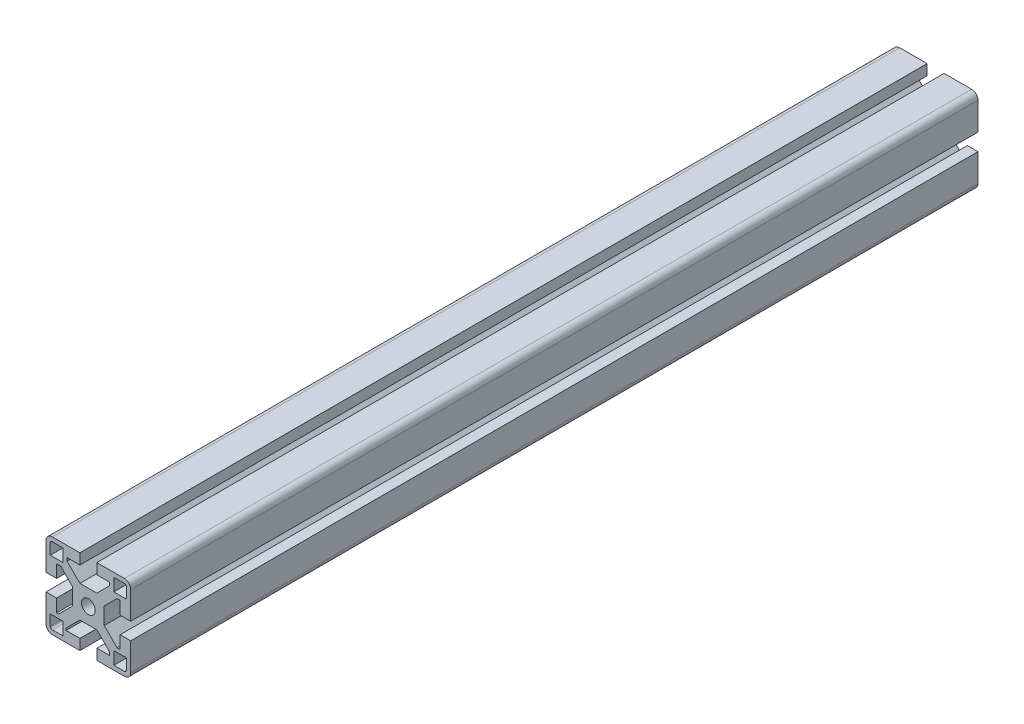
from build123d import *

# Parameters (mm, degrees)
CROQUIS1_R     = 3.25
EXTRUIR5_DEPTH = 400


with BuildPart() as part:
    # Croquis1 → Extruir5 (new body)
    with BuildSketch(Plane.XY):
        with BuildLine():
            Line((-4, 7.5), (4, 7.5))
            Line((4, 7.5), (10.05, 13.55))
            Line((10.05, 13.55), (10.05, 15))
            Line((10.05, 15), (4, 15))
            Line((4, 15), (4, 20))
            Line((4, 20), (17, 20))
            ThreePointArc((17, 20), (19.121320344, 19.121320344), (20, 17))
            Line((20, 17), (20, 4))
            Line((20, 4), (15, 4))
            Line((15, 4), (15, 10.05))
            Line((15, 10.05), (13.55, 10.05))
            Line((13.55, 10.05), (7.5, 4))
            Line((7.5, 4), (7.5, -4))
            Line((7.5, -4), (13.55, -10.05))
            Line((13.55, -10.05), (15, -10.05))
            Line((15, -10.05), (15, -4))
            Line((15, -4), (20, -4))
            Line((20, -4), (20, -17))
            ThreePointArc((20, -17), (19.121320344, -19.121320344), (17, -20))
            Line((17, -20), (4, -20))
            Line((4, -20), (4, -15))
            Line((4, -15), (10.05, -15))
            Line((10.05, -15), (10.05, -13.55))
            Line((10.05, -13.55), (4, -7.5))
            Line((4, -7.5), (-4, -7.5))
            Line((-4, -7.5), (-10.5, -14))
            Line((-10.5, -14), (-10.5, -15))
            Line((-10.5, -15), (-4, -15))
            Line((-4, -15), (-4, -20))
            Line((-4, -20), (-17, -20))
            ThreePointArc((-17, -20), (-19.121320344, -19.121320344), (-20, -17))
            Line((-20, -17), (-20, -4))
            Line((-20, -4), (-15, -4))
            Line((-15, -4), (-15, -10.05))
            Line((-15, -10.05), (-14, -10.05))
            Line((-14, -10.05), (-7.5, -3.55))
            Line((-7.5, -3.55), (-7.5, 4.45))
            Line((-7.5, 4.45), (-13.1, 10.05))
            Line((-13.1, 10.05), (-15, 10.05))
            Line((-15, 10.05), (-15, 4))
            Line((-15, 4), (-20, 4))
            Line((-20, 4), (-20, 17))
            ThreePointArc((-20, 17), (-19.121320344, 19.121320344), (-17, 20))
            Line((-17, 20), (-4, 20))
            Line((-4, 20), (-4, 15))
            Line((-4, 15), (-10.062875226, 15))
            Line((-10.062875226, 15), (-10.062875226, 13.55))
            Line((-10.062875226, 13.55), (-4, 7.5))
        make_face()
        Circle(CROQUIS1_R, mode=Mode.SUBTRACT)
        with BuildLine():
            Line((-18, 12), (-12, 12))
            Line((-12, 12), (-12, 18))
            Line((-12, 18), (-17, 18))
            ThreePointArc((-17, 18), (-17.707106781, 17.707106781), (-18, 17))
            Line((-18, 17), (-18, 12))
        make_face(mode=Mode.SUBTRACT)
        with BuildLine():
            Line((12, 12), (18, 12))
            Line((18, 12), (18, 17))
            ThreePointArc((18, 17), (17.707106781, 17.707106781), (17, 18))
            Line((17, 18), (12, 18))
            Line((12, 18), (12, 12))
        make_face(mode=Mode.SUBTRACT)
        with BuildLine():
            Line((-17, -18), (-12, -18))
            Line((-12, -18), (-12, -12))
            Line((-12, -12), (-18, -12))
            Line((-18, -12), (-18, -17))
            ThreePointArc((-18, -17), (-17.707106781, -17.707106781), (-17, -18))
        make_face(mode=Mode.SUBTRACT)
        with BuildLine():
            Line((18, -12), (12, -12))
            Line((12, -12), (12, -18))
            Line((12, -18), (17, -18))
            ThreePointArc((17, -18), (17.707106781, -17.707106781), (18, -17))
            Line((18, -17), (18, -12))
        make_face(mode=Mode.SUBTRACT)
    extrude(amount=EXTRUIR5_DEPTH)


solid = part.part
